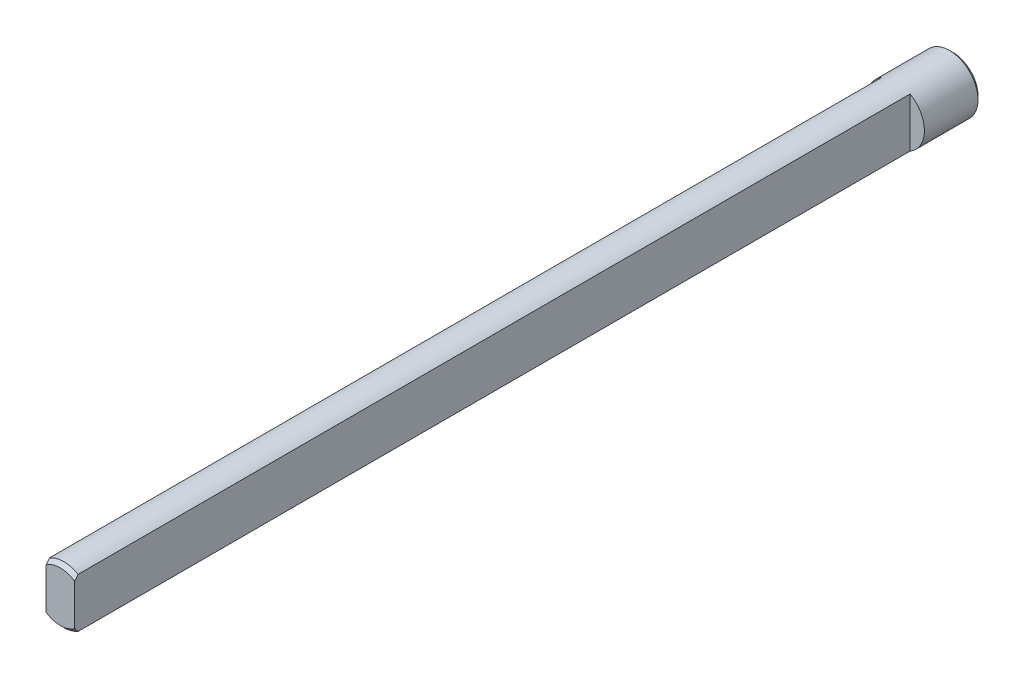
from build123d import *

# Parameters (mm, degrees)
ESQUISSE1_R             = 4
BOSS_EXTRU_1_DEPTH      = 125
CHANFREIN1_SIZE         = 0.5
ENL_V_START             = -8
ENL_V_MAT_EXTRU_1_DEPTH = 122
TROU_TARAUD_M41_D       = 3.3
TROU_TARAUD_M41_DEPTH   = 18.5
TROU_TARAUD_M41_TIP     = 0.991420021


with BuildPart() as part:
    # Esquisse1 → Boss.-Extru.1 (new body)
    with BuildSketch(Plane.XY):
        Circle(ESQUISSE1_R)
    extrude(amount=BOSS_EXTRU_1_DEPTH)

    # Chanfrein1
    chanfrein1_edges = [part.edges().sort_by_distance(p)[0] for p in [
        (-4, 0, 0),
        (-4, 0, 125),
    ]]
    chamfer(chanfrein1_edges, length=CHANFREIN1_SIZE)

    # Esquisse3 → Enl_v. mat.-Extru.1 (cut)
    with BuildSketch(Plane(origin=(0, 0, 0), x_dir=(-1, 0, 0), z_dir=(0, 0, -1)).offset(ENL_V_START)):
        with BuildLine():
            Line((-2, 3.464101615), (-2, -3.464101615))
            ThreePointArc((-2, -3.464101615), (-4, 0), (-2, 3.464101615))
        make_face()
        with BuildLine():
            Line((2, 3.464101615), (2, -3.464101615))
            ThreePointArc((2, -3.464101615), (4, 0), (2, 3.464101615))
        make_face()
    extrude(amount=-ENL_V_MAT_EXTRU_1_DEPTH, mode=Mode.SUBTRACT)

    # Trou taraud_ M41
    with Locations(Plane(origin=(0, 0, 0), x_dir=(-1, 0, 0), z_dir=(0, 0, -1))):
        with Locations((0, 0)):
            Hole(TROU_TARAUD_M41_D / 2, depth=TROU_TARAUD_M41_DEPTH)
            with Locations((0, 0, -(TROU_TARAUD_M41_DEPTH + TROU_TARAUD_M41_TIP / 2))):  # 118° drill point
                Cone(0, TROU_TARAUD_M41_D / 2, TROU_TARAUD_M41_TIP, mode=Mode.SUBTRACT)


solid = part.part
